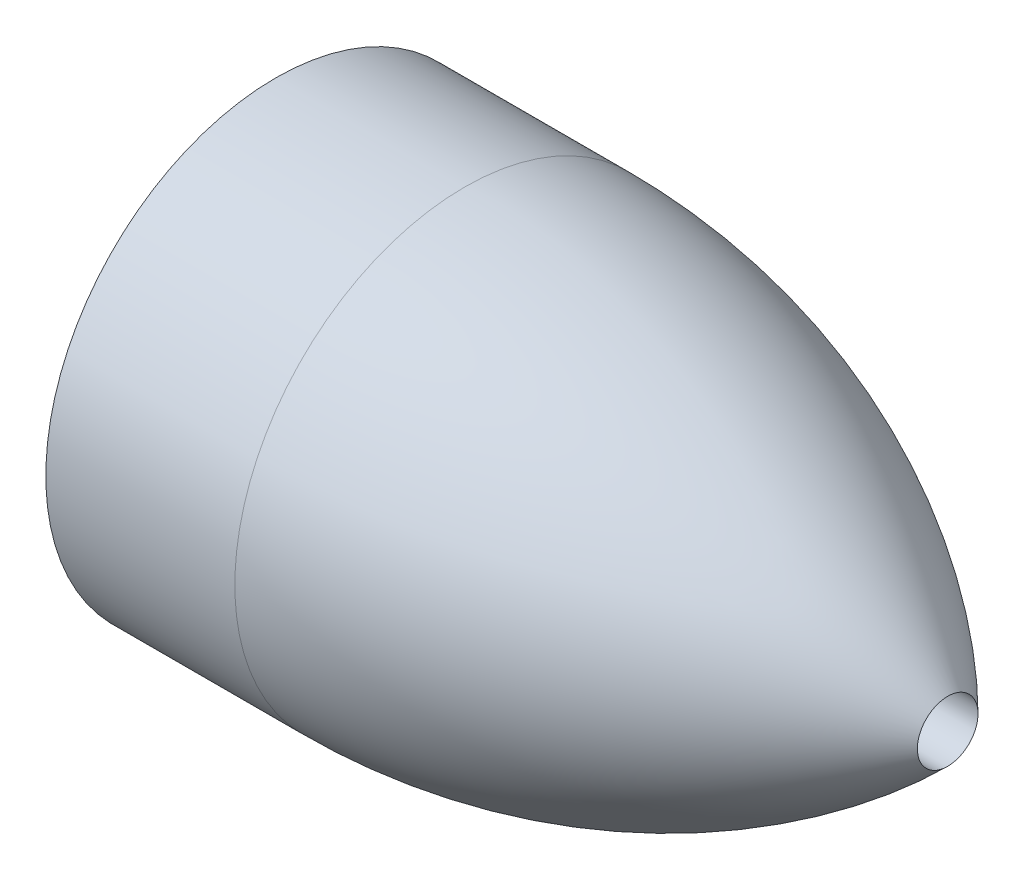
from build123d import *

# Parameters (mm, degrees)
SKETCH2_R          = 4.500033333
CUT_EXTRUDE2_DEPTH = 113.463824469


with BuildPart() as part:
    # Sketch1 → Revolve1 (revolve)
    with BuildSketch(Plane.XY):
        with BuildLine():
            ThreePointArc((99.730200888, 4.500033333), (66.823950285, 26.408536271), (28.046986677, 34.0995))
            Line((28.046986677, 34.0995), (0, 34.0995))
            Line((0, 34.0995), (0, 29.337))
            Line((0, 29.337), (41.275, 29.337))
            Line((41.275, 29.337), (45.548320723, 22.225))
            Line((45.548320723, 22.225), (67.509085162, 22.225))
            Line((67.509085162, 22.225), (73.232282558, 12.7))
            Line((73.232282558, 12.7), (85.056226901, 12.7))
            Line((85.056226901, 12.7), (92.687156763, 0))
            Line((92.687156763, 0), (101.6, 0))
            ThreePointArc((101.6, 0), (101.113948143, 2.436516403), (99.730200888, 4.500033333))
        make_face()
    revolve(axis=Axis((101.6, 0, 0), (-1, 0, 0)))

    # Sketch2 → Cut-Extrude2 (cut, through all)
    with BuildSketch(Plane(origin=(0, 0, 0), x_dir=(0, 0, -1), z_dir=(1, 0, 0))):
        with Locations(Location((0, 0, 0), (0, 0, 270))):
            Circle(SKETCH2_R)
    extrude(amount=CUT_EXTRUDE2_DEPTH, mode=Mode.SUBTRACT)


solid = part.part
